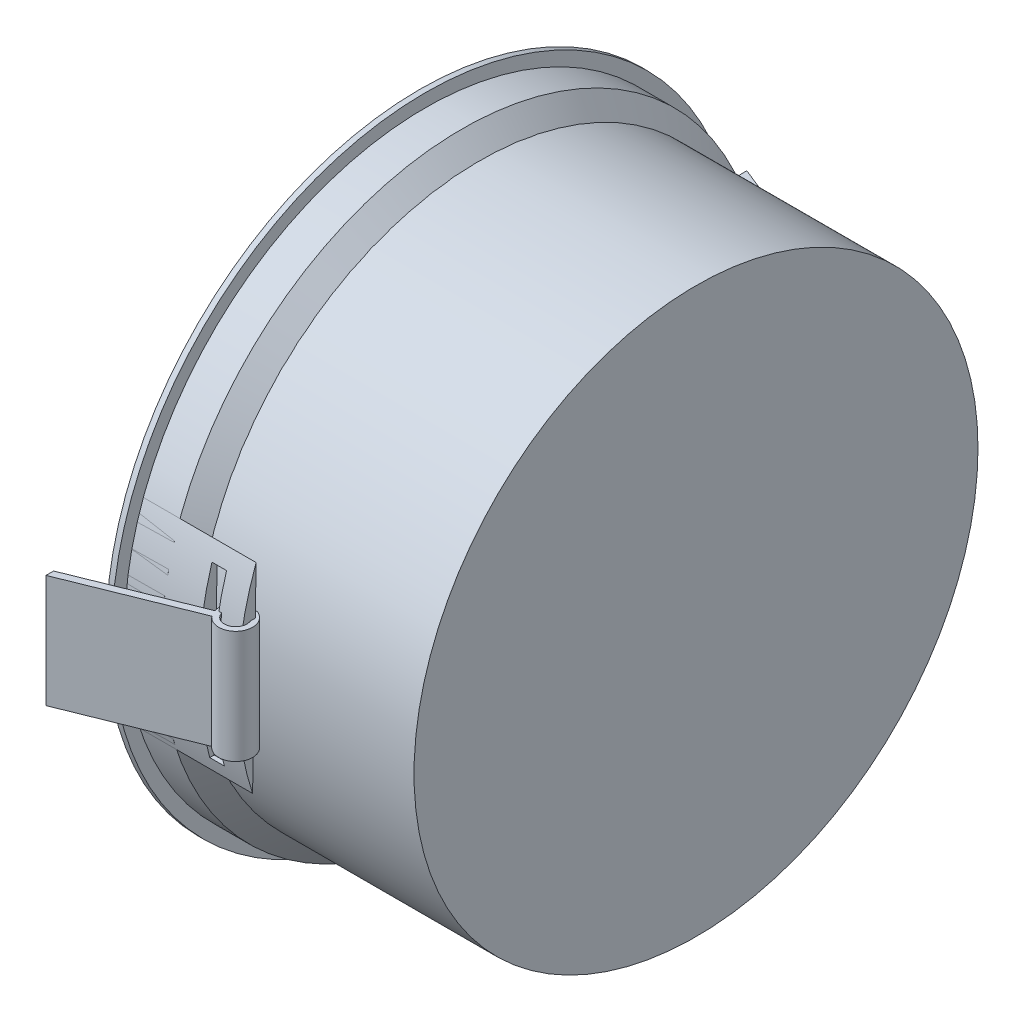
from build123d import *

# Parameters (mm, degrees)
CROQUIS28_R                   = 50
SALIENTE_EXTRUIR16_DEPTH      = 50
CROQUIS30_R                   = 45
CORTAR_EXTRUIR17_DEPTH        = 25
SALIENTE_EXTRUIR17_DEPTH      = 20
SALIENTE_EXTRUIR17_2_DEPTH    = 20
CORTAR_EXTRUIR18_DEPTH        = 70
CORTAR_EXTRUIR18_DEPTH_BACK   = 70
CROQUIS37_W                   = 2.585681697
CROQUIS37_H                   = 29.811388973
SALIENTE_EXTRUIR18_DEPTH      = 10
SALIENTE_EXTRUIR18_DEPTH_BACK = 10
CROQUIS39_R                   = 2


with BuildPart() as part:
    # Croquis28 → Saliente-Extruir16 (new body)
    with BuildSketch(Plane(origin=(56.1, 0, 0), x_dir=(0, 0, -1), z_dir=(1, 0, 0))):
        with Locations((0, -82.458223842)):
            Circle(CROQUIS28_R)
    extrude(amount=-SALIENTE_EXTRUIR16_DEPTH)

    # Croquis30 → Cortar-Extruir17 (cut)
    with BuildSketch(Plane.ZY.offset(-6.1)):
        with Locations((0, -82.458223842)):
            Circle(CROQUIS30_R)
    extrude(amount=-CORTAR_EXTRUIR17_DEPTH, mode=Mode.SUBTRACT)


with BuildPart() as body_2:
    # Croquis32 → Revoluci_n1 (revolve)
    with BuildSketch(Plane.XY, mode=Mode.PRIVATE) as revoluci_n1_sk:
        with BuildLine():
            Line((8.096262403, -47.458223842), (8.096262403, -40.458223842))
            Line((8.096262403, -40.458223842), (7.096262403, -40.458223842))
            Line((7.096262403, -40.458223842), (7.096262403, -47.458223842))
            ThreePointArc((7.096262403, -47.458223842), (12.95412678, -61.600359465), (27.096262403, -67.458223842))
            Line((27.096262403, -67.458223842), (27.096262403, -66.458223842))
            ThreePointArc((27.096262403, -66.458223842), (13.661233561, -60.893252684), (8.096262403, -47.458223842))
        make_face()
    revolve(revoluci_n1_sk.sketch.rotate(Axis((6.1, -82.458223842, 0), (1, 0, 0)), 90), axis=Axis((6.1, -82.458223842, 0), (1, 0, 0)))


with BuildPart() as body_3:
    # Croquis35 → Revoluci_n2 (revolve)
    with BuildSketch(Plane(origin=(0, -82.458223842, 0), x_dir=(1, 0, 0), z_dir=(0, 1, 0))):
        Polygon((7.108751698, -55.63397622), (7.108751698, -46.262983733), (8.108751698, -46.262983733), (8.108751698, -52.307285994), (14.179055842, -52.307285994), (36.881176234, -28.439175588), (36.881176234, -28.426338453), (36.881176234, -15.153505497), (37.881176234, -15.153505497), (37.881176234, -28.426338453), (47.029100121, -28.426338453), (47.029100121, -18.36753033), (48.029100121, -18.36753033), (48.029100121, -29.426338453), (37.322340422, -29.426338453), (14.608010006, -53.307285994), (8.108751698, -53.307285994), (8.108751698, -55.63397622), align=None)
    revolve(axis=Axis((6.1, -82.458223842, 0), (1, 0, 0)))


with BuildPart() as body_4:
    # Croquis36 → Saliente-Extruir17 (new body)
    with BuildSketch(Plane(origin=(8.108751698, 0, 0), x_dir=(0, 0, -1), z_dir=(1, 0, 0))):
        with BuildLine():
            Line((-50.004672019, -63.986637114), (-50.632861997, -99.130956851))
            ThreePointArc((-50.632861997, -99.130956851), (-53.298772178, -81.50553064), (-50.004672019, -63.986637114))
        make_face()
    extrude(amount=SALIENTE_EXTRUIR17_DEPTH)


with BuildPart() as body_5:
    # Croquis36 → Saliente-Extruir17 2 (new body)
    with BuildSketch(Plane(origin=(8.108751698, 0, 0), x_dir=(0, 0, -1), z_dir=(1, 0, 0))):
        with BuildLine():
            Line((50.004672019, -63.986637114), (50.632861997, -99.130956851))
            ThreePointArc((50.632861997, -99.130956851), (53.298772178, -81.50553064), (50.004672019, -63.986637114))
        make_face()
    extrude(amount=SALIENTE_EXTRUIR17_2_DEPTH)


with BuildPart() as cortar_extruir18_tool:
    # Croquis37 → Cortar-Extruir18 (new, two sides: drawn at the far end of the back side and taken through both)
    with BuildSketch(Plane.XY.offset(-CORTAR_EXTRUIR18_DEPTH_BACK)):
        with Locations((22.543416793, -81.773778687)):
            Rectangle(CROQUIS37_W, CROQUIS37_H)
    extrude(amount=CORTAR_EXTRUIR18_DEPTH + CORTAR_EXTRUIR18_DEPTH_BACK)


with BuildPart() as body_4_1:
    add(body_4.part)

    # Cortar-Extruir18: cut by cortar_extruir18_tool
    add(cortar_extruir18_tool.part, mode=Mode.SUBTRACT)


with BuildPart() as body_5_1:
    add(body_5.part)

    # Cortar-Extruir18: cut by cortar_extruir18_tool
    add(cortar_extruir18_tool.part, mode=Mode.SUBTRACT)


with BuildPart() as body_6:
    # Croquis39 → Saliente-Extruir18 (new, two sides: drawn at the far end of the back side and taken through both)
    with BuildSketch(Plane(origin=(0, -82.458223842, 0), x_dir=(1, 0, 0), z_dir=(0, 1, 0)).offset(-SALIENTE_EXTRUIR18_DEPTH_BACK)):
        with BuildLine():
            Line((23.368073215, -52.58147213), (2.978856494, -60.788004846))
            Line((2.978856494, -60.788004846), (2.978856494, -62.134128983))
            Line((2.978856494, -62.134128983), (23.944655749, -53.695525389))
            ThreePointArc((23.944655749, -53.695525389), (28.926111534, -50.411120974), (23.368073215, -52.58147213))
        make_face()
        with Locations(Location((26.261798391, -51.790046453, 0), (0, 0, 270))):
            Circle(CROQUIS39_R, mode=Mode.SUBTRACT)
    extrude(amount=SALIENTE_EXTRUIR18_DEPTH + SALIENTE_EXTRUIR18_DEPTH_BACK)


with BuildPart() as body_7:
    # Simetr_a2: mirrored copy
    add(body_6.part.mirror(Plane.XY))


solid = Compound([part.part, body_2.part, body_3.part, body_4_1.part, body_5_1.part, body_6.part, body_7.part])
